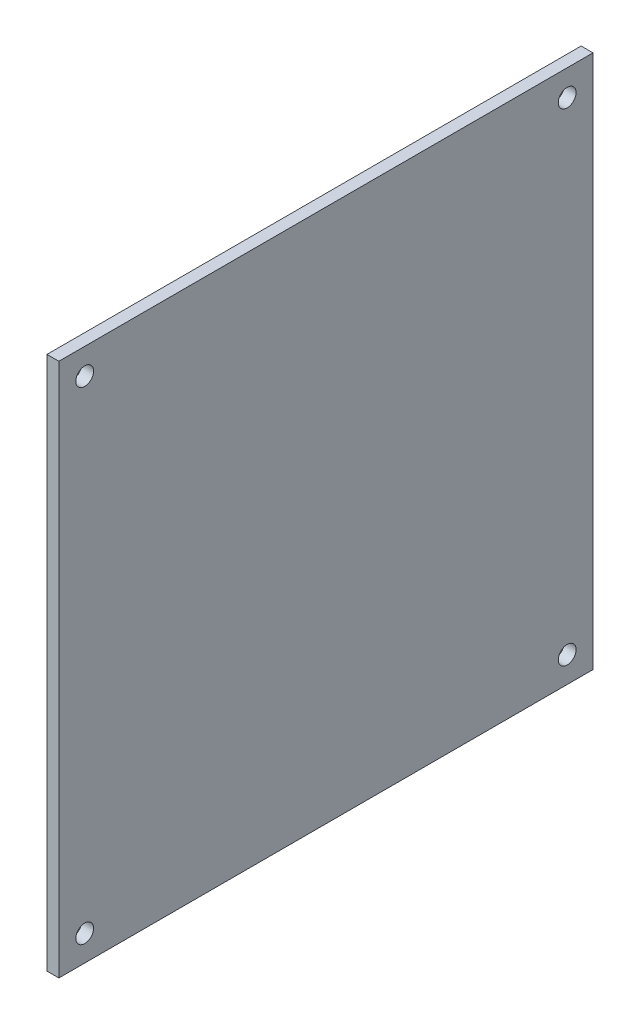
from build123d import *

# Parameters (mm, degrees)
ESQUISSE1_W        = 90
ESQUISSE1_H        = 90
ESQUISSE1_R        = 1.5
BOSS_EXTRU_1_DEPTH = 2


with BuildPart() as part:
    # Esquisse1 → Boss.-Extru.1 (new body)
    with BuildSketch(Plane(origin=(0, 0, 0), x_dir=(0, 0, -1), z_dir=(1, 0, 0))):
        with Locations((-0.251057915, -0.627644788)):
            Rectangle(ESQUISSE1_W, ESQUISSE1_H)
        with Locations((-40.901057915, 40.020099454)):
            Circle(ESQUISSE1_R, mode=Mode.SUBTRACT)
        with Locations((40.398942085, 40.022355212)):
            Circle(ESQUISSE1_R, mode=Mode.SUBTRACT)
        with Locations((40.398942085, -41.277644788)):
            Circle(ESQUISSE1_R, mode=Mode.SUBTRACT)
        with Locations((-40.901057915, -41.277644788)):
            Circle(ESQUISSE1_R, mode=Mode.SUBTRACT)
    extrude(amount=BOSS_EXTRU_1_DEPTH)


solid = part.part
